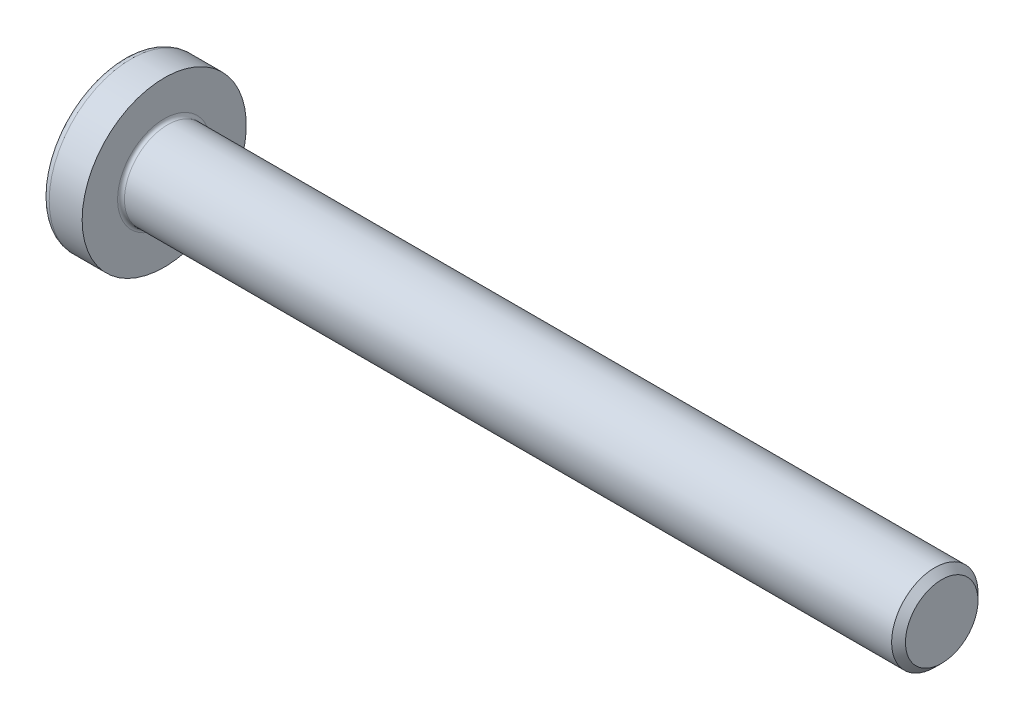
from build123d import *

# Parameters (mm, degrees)
FILLET1_R       = 0.2
RECPAT_COUNT    = 2
RECPAT_ANGLE    = 90
CHANFREIN1_SIZE = 0.4


with BuildPart() as part:
    # BodySke → Base-Revolve (revolve)
    with BuildSketch(Plane.XY, mode=Mode.PRIVATE) as base_revolve_sk:
        with BuildLine():
            Line((3.7, 2.5), (3.7, 4.75))
            Line((3.7, 4.75), (1.79415598, 4.75))
            ThreePointArc((1.79415598, 4.75), (1.58538712, 4.698642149), (1.424271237, 4.556291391))
            ThreePointArc((1.424271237, 4.556291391), (0.364365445, 2.386856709), (0, 0))
            Line((0, 0), (48.7, 0))
            Line((48.7, 0), (48.7, 2.5))
            Line((48.7, 2.5), (3.7, 2.5))
        make_face()
    revolve(base_revolve_sk.sketch.rotate(Axis((1.79415598, 0, 0), (1, 0, 0)), 90), axis=Axis((1.79415598, 0, 0), (1, 0, 0)))

    # Fillet1
    fillet1_edges = [part.edges().sort_by_distance(p)[0] for p in [
        (3.7, 0, -2.5),
    ]]
    fillet(fillet1_edges, radius=FILLET1_R)

    # Sketch3 → Recess section 0
    with BuildSketch(Plane(origin=(0, 0, 0), x_dir=(0, 0, -1), z_dir=(1, 0, 0))):
        with BuildLine():
            Line((0.515, -2.35), (-0.515, -2.35))
            Line((-0.515, -2.35), (-0.515, 2.35))
            Line((-0.515, 2.35), (0.515, 2.35))
            Line((0.515, 2.35), (0.515, -2.35))
        make_face()
    # Sketch4 → Recess section 1
    with BuildSketch(Plane(origin=(2.74, 0, 0), x_dir=(0, 0, -1), z_dir=(1, 0, 0))):
        with BuildLine():
            Line((0.515, -0.983886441), (-0.515, -0.983886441))
            Line((-0.515, -0.983886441), (-0.515, 0.983886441))
            Line((-0.515, 0.983886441), (0.515, 0.983886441))
            Line((0.515, 0.983886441), (0.515, -0.983886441))
        make_face()
    recess = loft(mode=Mode.SUBTRACT)

    # RecPat: Recess ×2 about axis
    recpat_axis = Axis((0, 0, 0), (1, 0, 0))
    for i in range(1, RECPAT_COUNT):
        add(recess.rotate(recpat_axis, i * RECPAT_ANGLE / (RECPAT_COUNT - 1)), mode=Mode.SUBTRACT)

    # RecCorSke → RecessCore (revolve, cut)
    with BuildSketch(Plane.XY, mode=Mode.PRIVATE) as recesscore_sk:
        Polygon((0, 0), (0, 1.042599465), (2.74, 0.851), (3.016506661, 0), align=None)
    revolve(recesscore_sk.sketch.rotate(Axis((-3.175, 0, 0), (1, 0, 0)), 13.238159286), axis=Axis((-3.175, 0, 0), (1, 0, 0)), mode=Mode.SUBTRACT)

    # Chanfrein1
    chanfrein1_edges = [part.edges().sort_by_distance(p)[0] for p in [
        (48.7, 0, -2.5),
    ]]
    chamfer(chanfrein1_edges, length=CHANFREIN1_SIZE)


solid = part.part
